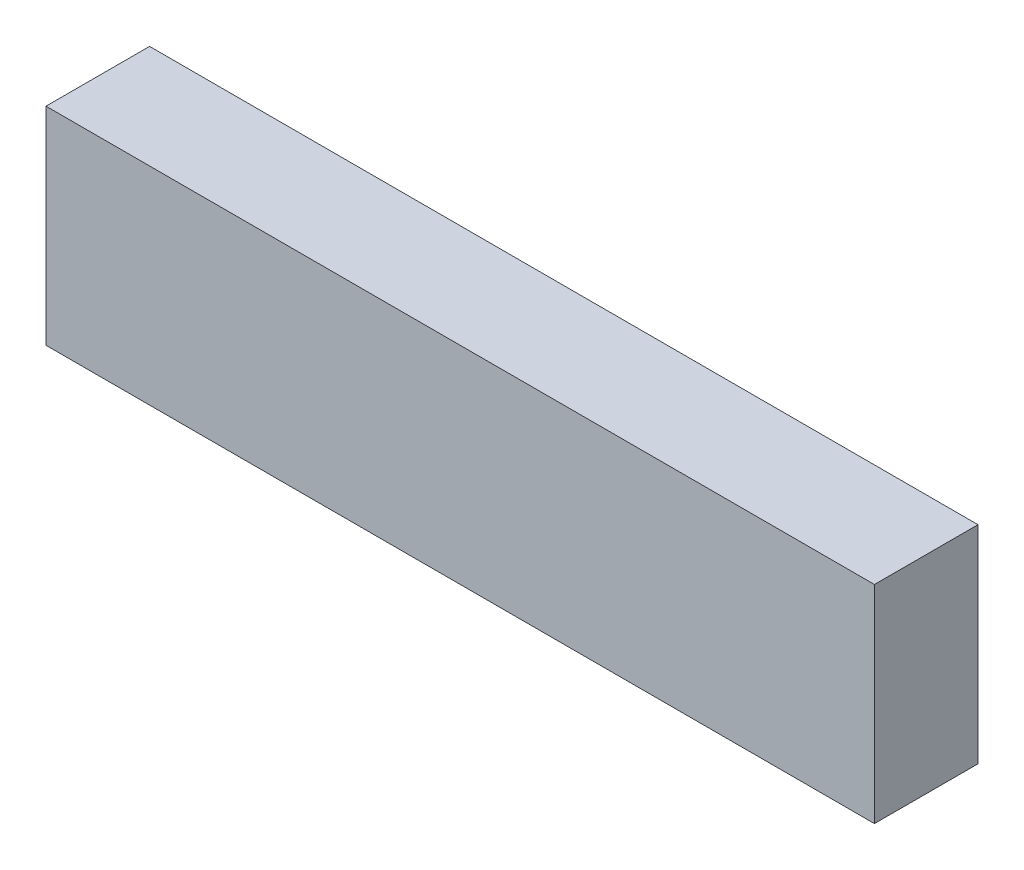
from build123d import *

# Parameters (mm, degrees)
ESQUISSE1_W          = 40
ESQUISSE1_H          = 10
BASE_EXTRUSION_DEPTH = 5


with BuildPart() as part:
    # Esquisse1 → Base-Extrusion (new body)
    with BuildSketch(Plane.XY):
        with Locations((20, 5)):
            Rectangle(ESQUISSE1_W, ESQUISSE1_H)
    extrude(amount=BASE_EXTRUSION_DEPTH)


solid = part.part
